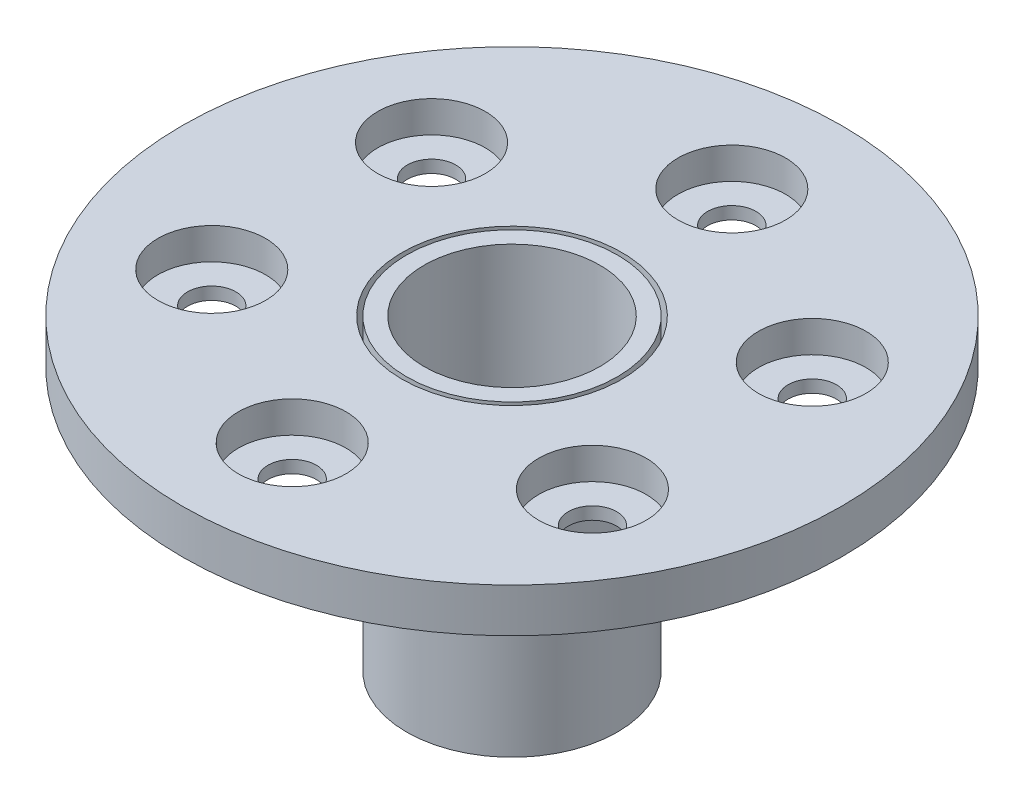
from build123d import *

# Parameters (mm, degrees)
SKETCH1_R         = 37.5
SKETCH1_R_2       = 12.5
EXTRUDE1_DEPTH    = 5
SKETCH2_R         = 12
SKETCH2_R_2       = 10
EXTRUDE2_DEPTH    = 35
CIRPATTERN1_COUNT = 6


with BuildPart() as part:
    # Sketch1 → Extrude1 (new body)
    with BuildSketch(Plane(origin=(0, 0, 0), x_dir=(1, 0, 0), z_dir=(0, 1, 0))):
        with Locations(Location((0, 0, 0), (0, 0, 270))):
            Circle(SKETCH1_R)
        with Locations(Location((0, 0, 0), (0, 0, 270))):
            Circle(SKETCH1_R_2, mode=Mode.SUBTRACT)
    extrude(amount=EXTRUDE1_DEPTH)

    # Sketch4 → CBORE for M5 Hex Head Bolt1 (revolve, cut)
    with BuildSketch(Plane(origin=(0, 5, 25), x_dir=(0, 0, 1), z_dir=(1, 0, 0))):
        Polygon((0, 0), (0, 5), (2.75, 5), (2.75, 3.58), (6.12, 3.58), (6.12, 0), align=None)
    cbore_for_m5_hex_head_bolt1 = revolve(axis=Axis((0, 11.35, 25), (0, -1, 0)), mode=Mode.SUBTRACT)

    # CirPattern1: CBORE for M5 Hex Head Bolt1 ×6 about axis
    cirpattern1_axis = Axis((0, 0, 0), (0, 1, 0))
    for i in range(1, CIRPATTERN1_COUNT):
        add(cbore_for_m5_hex_head_bolt1.rotate(cirpattern1_axis, i * 360 / CIRPATTERN1_COUNT), mode=Mode.SUBTRACT)


with BuildPart() as body_2:
    # Sketch2 → Extrude2 (new body)
    with BuildSketch(Plane(origin=(0, 5, 0), x_dir=(-1, 0, 0), z_dir=(0, 1, 0))):
        with Locations(Location((0, 0, 0), (0, 0, 90))):
            Circle(SKETCH2_R)
        with Locations(Location((0, 0, 0), (0, 0, 90))):
            Circle(SKETCH2_R_2, mode=Mode.SUBTRACT)
    extrude(amount=-EXTRUDE2_DEPTH)


solid = Compound([part.part, body_2.part])
